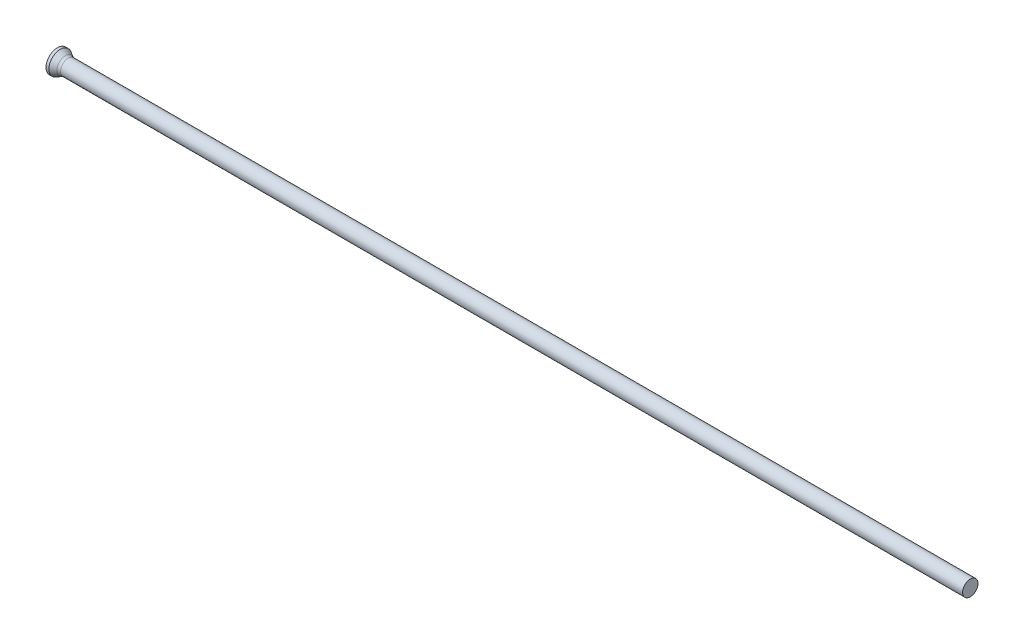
ISO-10303-21;
HEADER;
FILE_DESCRIPTION(('STEP AP214'),'2;1');
FILE_NAME('part.step','',(''),(''),'','','');
FILE_SCHEMA(('AUTOMOTIVE_DESIGN { 1 0 10303 214 1 1 1 1 }'));
ENDSEC;
DATA;
#1=APPLICATION_CONTEXT('core data for automotive mechanical design processes');
#2=APPLICATION_PROTOCOL_DEFINITION('international standard','automotive_design',2000,#1);
#3=PRODUCT_CONTEXT('',#1,'mechanical');
#4=PRODUCT('Part','Part','',(#3));
#5=PRODUCT_RELATED_PRODUCT_CATEGORY('part','',(#4));
#6=PRODUCT_DEFINITION_FORMATION('','',#4);
#7=PRODUCT_DEFINITION_CONTEXT('part definition',#1,'design');
#8=PRODUCT_DEFINITION('design','',#6,#7);
#9=PRODUCT_DEFINITION_SHAPE('','',#8);
#10=(LENGTH_UNIT() NAMED_UNIT(*) SI_UNIT(.MILLI.,.METRE.));
#11=(NAMED_UNIT(*) PLANE_ANGLE_UNIT() SI_UNIT($,.RADIAN.));
#12=(NAMED_UNIT(*) SI_UNIT($,.STERADIAN.) SOLID_ANGLE_UNIT());
#13=UNCERTAINTY_MEASURE_WITH_UNIT(LENGTH_MEASURE(1.E-05),#10,'distance_accuracy_value','');
#14=(GEOMETRIC_REPRESENTATION_CONTEXT(3) GLOBAL_UNCERTAINTY_ASSIGNED_CONTEXT((#13)) GLOBAL_UNIT_ASSIGNED_CONTEXT((#10,
#11,#12)) REPRESENTATION_CONTEXT('',''));
#15=CARTESIAN_POINT('',(0.,0.,0.));
#16=DIRECTION('',(0.,0.,1.));
#17=DIRECTION('',(1.,0.,0.));
#18=AXIS2_PLACEMENT_3D('',#15,#16,#17);
#19=CARTESIAN_POINT('',(0.,0.,0.));
#20=DIRECTION('',(1.,0.,0.));
#21=DIRECTION('',(0.,0.,-1.));
#22=AXIS2_PLACEMENT_3D('',#19,#20,#21);
#23=PLANE('',#22);
#24=CARTESIAN_POINT('',(0.,0.,0.));
#25=DIRECTION('',(-1.,0.,0.));
#26=DIRECTION('',(0.,0.,1.));
#27=AXIS2_PLACEMENT_3D('',#24,#25,#26);
#28=CIRCLE('',#27,2.);
#29=CARTESIAN_POINT('',(0.,0.,2.));
#30=VERTEX_POINT('',#29);
#31=EDGE_CURVE('E25',#30,#30,#28,.T.);
#32=ORIENTED_EDGE('',*,*,#31,.T.);
#33=EDGE_LOOP('',(#32));
#34=FACE_BOUND('',#33,.T.);
#35=ADVANCED_FACE('F14',(#34),#23,.F.);
#36=CARTESIAN_POINT('',(0.,0.,0.));
#37=DIRECTION('',(-1.,0.,0.));
#38=DIRECTION('',(0.,0.,1.));
#39=AXIS2_PLACEMENT_3D('',#36,#37,#38);
#40=CYLINDRICAL_SURFACE('',#39,2.);
#41=ORIENTED_EDGE('',*,*,#31,.F.);
#42=EDGE_LOOP('',(#41));
#43=FACE_BOUND('',#42,.T.);
#44=CARTESIAN_POINT('',(0.504166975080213,0.,0.));
#45=DIRECTION('',(-1.,0.,0.));
#46=DIRECTION('',(0.,0.,1.));
#47=AXIS2_PLACEMENT_3D('',#44,#45,#46);
#48=CIRCLE('',#47,2.);
#49=CARTESIAN_POINT('',(0.504166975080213,0.,2.));
#50=VERTEX_POINT('',#49);
#51=EDGE_CURVE('E29',#50,#50,#48,.T.);
#52=ORIENTED_EDGE('',*,*,#51,.T.);
#53=EDGE_LOOP('',(#52));
#54=FACE_BOUND('',#53,.T.);
#55=ADVANCED_FACE('F53',(#43,#54),#40,.T.);
#56=CARTESIAN_POINT('',(1.63,0.,0.));
#57=DIRECTION('',(-1.,0.,0.));
#58=DIRECTION('',(0.,0.,1.));
#59=AXIS2_PLACEMENT_3D('',#56,#57,#58);
#60=CONICAL_SURFACE('',#59,1.35,0.523598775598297);
#61=CARTESIAN_POINT('',(1.39794919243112,0.,0.));
#62=DIRECTION('',(-1.,0.,0.));
#63=DIRECTION('',(0.,0.,1.));
#64=AXIS2_PLACEMENT_3D('',#61,#62,#63);
#65=CIRCLE('',#64,1.48397459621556);
#66=CARTESIAN_POINT('',(1.39794919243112,0.,1.48397459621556));
#67=VERTEX_POINT('',#66);
#68=EDGE_CURVE('E21',#67,#67,#65,.T.);
#69=ORIENTED_EDGE('',*,*,#68,.T.);
#70=EDGE_LOOP('',(#69));
#71=FACE_BOUND('',#70,.T.);
#72=ORIENTED_EDGE('',*,*,#51,.F.);
#73=EDGE_LOOP('',(#72));
#74=FACE_BOUND('',#73,.T.);
#75=ADVANCED_FACE('F50',(#71,#74),#60,.T.);
#76=CARTESIAN_POINT('',(0.,0.,0.));
#77=DIRECTION('',(-1.,0.,0.));
#78=DIRECTION('',(0.,0.,1.));
#79=AXIS2_PLACEMENT_3D('',#76,#77,#78);
#80=CYLINDRICAL_SURFACE('',#79,1.35);
#81=CARTESIAN_POINT('',(1.89794919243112,0.,0.));
#82=DIRECTION('',(-1.,0.,0.));
#83=DIRECTION('',(0.,0.,1.));
#84=AXIS2_PLACEMENT_3D('',#81,#82,#83);
#85=CIRCLE('',#84,1.35);
#86=CARTESIAN_POINT('',(1.89794919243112,0.,1.35));
#87=VERTEX_POINT('',#86);
#88=EDGE_CURVE('E9',#87,#87,#85,.F.);
#89=ORIENTED_EDGE('',*,*,#88,.T.);
#90=EDGE_LOOP('',(#89));
#91=FACE_BOUND('',#90,.T.);
#92=CARTESIAN_POINT('',(160.,0.,0.));
#93=DIRECTION('',(-1.,0.,0.));
#94=DIRECTION('',(0.,0.,1.));
#95=AXIS2_PLACEMENT_3D('',#92,#93,#94);
#96=CIRCLE('',#95,1.35);
#97=CARTESIAN_POINT('',(160.,0.,1.35));
#98=VERTEX_POINT('',#97);
#99=EDGE_CURVE('E34',#98,#98,#96,.T.);
#100=ORIENTED_EDGE('',*,*,#99,.T.);
#101=EDGE_LOOP('',(#100));
#102=FACE_BOUND('',#101,.T.);
#103=ADVANCED_FACE('F38',(#91,#102),#80,.T.);
#104=CARTESIAN_POINT('',(160.,1.35,0.));
#105=DIRECTION('',(-1.,0.,0.));
#106=DIRECTION('',(0.,0.,1.));
#107=AXIS2_PLACEMENT_3D('',#104,#105,#106);
#108=PLANE('',#107);
#109=ORIENTED_EDGE('',*,*,#99,.F.);
#110=EDGE_LOOP('',(#109));
#111=FACE_BOUND('',#110,.T.);
#112=ADVANCED_FACE('F40',(#111),#108,.F.);
#113=CARTESIAN_POINT('',(1.89794919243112,0.,0.));
#114=DIRECTION('',(-1.,0.,0.));
#115=DIRECTION('',(0.,0.,1.));
#116=AXIS2_PLACEMENT_3D('',#113,#114,#115);
#117=TOROIDAL_SURFACE('',#116,2.35,1.);
#118=ORIENTED_EDGE('',*,*,#88,.F.);
#119=EDGE_LOOP('',(#118));
#120=FACE_BOUND('',#119,.T.);
#121=ORIENTED_EDGE('',*,*,#68,.F.);
#122=EDGE_LOOP('',(#121));
#123=FACE_BOUND('',#122,.T.);
#124=ADVANCED_FACE('F16',(#120,#123),#117,.F.);
#125=CLOSED_SHELL('',(#35,#55,#75,#103,#112,#124));
#126=MANIFOLD_SOLID_BREP('B1',#125);
#127=ADVANCED_BREP_SHAPE_REPRESENTATION('',(#18,#126),#14);
#128=SHAPE_DEFINITION_REPRESENTATION(#9,#127);
ENDSEC;
END-ISO-10303-21;
